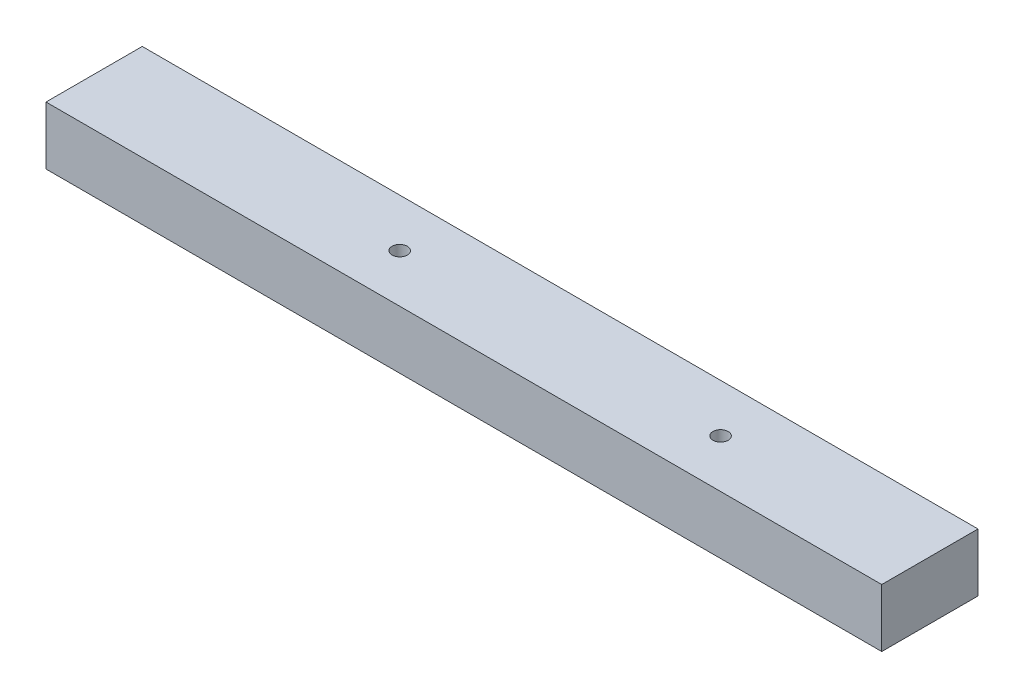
from build123d import *

# Parameters (mm, degrees)
SKETCH1_W           = 1220
SKETCH1_H           = 63
BOSS_EXTRUDE1_DEPTH = 38
SKETCH2_R           = 5
CUT_EXTRUDE1_DEPTH  = 38
CUT_EXTRUDE2_REACH  = 1224.216
SKETCH3_W           = 610
SKETCH3_H           = 63
SKETCH3_W_2         = 63


with BuildPart() as part:
    # Sketch1 → Boss-Extrude1 (new body)
    with BuildSketch(Plane(origin=(0, 0, 0), x_dir=(1, 0, 0), z_dir=(0, 1, 0))):
        with Locations((610, 31.5)):
            Rectangle(SKETCH1_W, SKETCH1_H)
    extrude(amount=BOSS_EXTRUDE1_DEPTH)

    # Sketch2 → Cut-Extrude1 (cut)
    with BuildSketch(Plane(origin=(0, 38, 0), x_dir=(1, 0, 0), z_dir=(0, 1, 0))):
        with Locations(Location((200, 31.5, 0), (0, 0, 270))):
            Circle(SKETCH2_R)
        with Locations(Location((410, 31.5, 0), (0, 0, 270))):
            Circle(SKETCH2_R)
        with Locations(Location((810, 31.5, 0), (0, 0, 90))):
            Circle(SKETCH2_R)
        with Locations(Location((1020, 31.5, 0), (0, 0, 90))):
            Circle(SKETCH2_R)
    extrude(amount=-CUT_EXTRUDE1_DEPTH, mode=Mode.SUBTRACT)

    # Sketch3 → Cut-Extrude2 (cut, up to next)
    with BuildSketch(Plane(origin=(0, 38, 0), x_dir=(1, 0, 0), z_dir=(0, 1, 0)), mode=Mode.PRIVATE) as cut_extrude2_sk1:
        with Locations((305, 31.5)):
            Rectangle(SKETCH3_W, SKETCH3_H)
    cut_extrude2_tool1 = extrude(cut_extrude2_sk1.sketch, amount=-CUT_EXTRUDE2_REACH, mode=Mode.PRIVATE) & part.part
    # Sketch3 → Cut-Extrude2 (cut, up to next)
    with BuildSketch(Plane(origin=(0, 38, 0), x_dir=(1, 0, 0), z_dir=(0, 1, 0)), mode=Mode.PRIVATE) as cut_extrude2_sk2:
        with Locations((1188.5, 31.5)):
            Rectangle(SKETCH3_W_2, SKETCH3_H)
    cut_extrude2_tool2 = extrude(cut_extrude2_sk2.sketch, amount=-CUT_EXTRUDE2_REACH, mode=Mode.PRIVATE) & part.part
    add(cut_extrude2_tool1.solids().sort_by_distance((305, 38, -31.5))[0], mode=Mode.SUBTRACT)
    add(cut_extrude2_tool2.solids().sort_by_distance((1188.5, 38, -31.5))[0], mode=Mode.SUBTRACT)


solid = part.part
